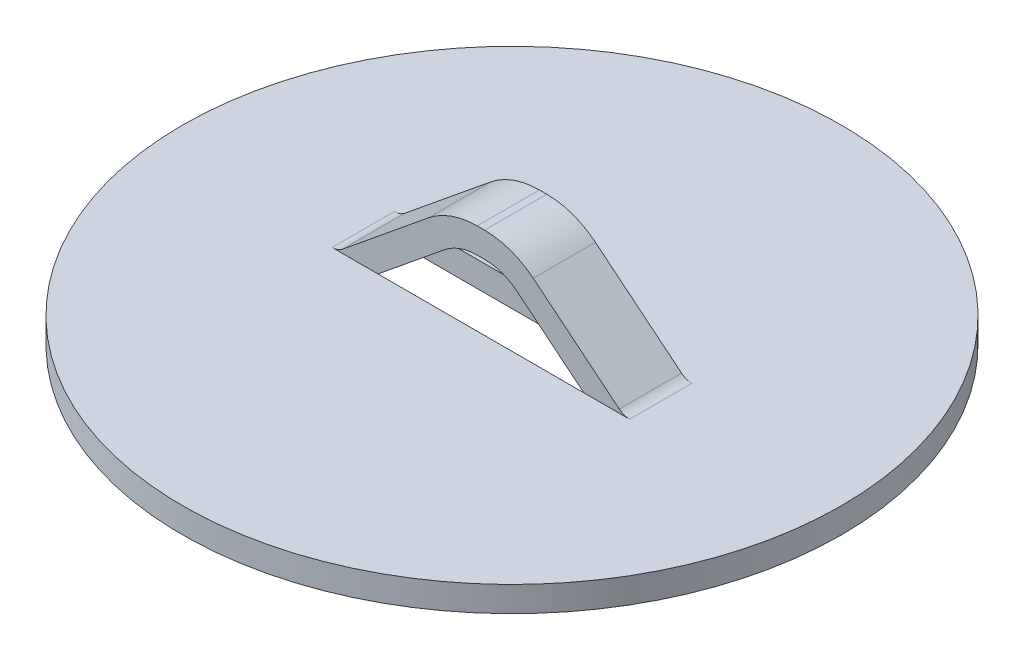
ISO-10303-21;
HEADER;
FILE_DESCRIPTION(('STEP AP214'),'2;1');
FILE_NAME('part.step','',(''),(''),'','','');
FILE_SCHEMA(('AUTOMOTIVE_DESIGN { 1 0 10303 214 1 1 1 1 }'));
ENDSEC;
DATA;
#1=APPLICATION_CONTEXT('core data for automotive mechanical design processes');
#2=APPLICATION_PROTOCOL_DEFINITION('international standard','automotive_design',2000,#1);
#3=PRODUCT_CONTEXT('',#1,'mechanical');
#4=PRODUCT('Part','Part','',(#3));
#5=PRODUCT_RELATED_PRODUCT_CATEGORY('part','',(#4));
#6=PRODUCT_DEFINITION_FORMATION('','',#4);
#7=PRODUCT_DEFINITION_CONTEXT('part definition',#1,'design');
#8=PRODUCT_DEFINITION('design','',#6,#7);
#9=PRODUCT_DEFINITION_SHAPE('','',#8);
#10=(LENGTH_UNIT() NAMED_UNIT(*) SI_UNIT(.MILLI.,.METRE.));
#11=(NAMED_UNIT(*) PLANE_ANGLE_UNIT() SI_UNIT($,.RADIAN.));
#12=(NAMED_UNIT(*) SI_UNIT($,.STERADIAN.) SOLID_ANGLE_UNIT());
#13=UNCERTAINTY_MEASURE_WITH_UNIT(LENGTH_MEASURE(1.E-05),#10,'distance_accuracy_value','');
#14=(GEOMETRIC_REPRESENTATION_CONTEXT(3) GLOBAL_UNCERTAINTY_ASSIGNED_CONTEXT((#13)) GLOBAL_UNIT_ASSIGNED_CONTEXT((#10,
#11,#12)) REPRESENTATION_CONTEXT('',''));
#15=CARTESIAN_POINT('',(0.,0.,0.));
#16=DIRECTION('',(0.,0.,1.));
#17=DIRECTION('',(1.,0.,0.));
#18=AXIS2_PLACEMENT_3D('',#15,#16,#17);
#19=CARTESIAN_POINT('',(-7.16391617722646,0.7874,-2.9972));
#20=DIRECTION('',(0.,0.,-1.));
#21=DIRECTION('',(-1.,0.,0.));
#22=AXIS2_PLACEMENT_3D('',#19,#20,#21);
#23=PLANE('',#22);
#24=DIRECTION('',(0.774751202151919,0.632266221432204,0.));
#25=VECTOR('',#24,1.);
#26=CARTESIAN_POINT('',(-5.89521077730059,-0.767215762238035,-2.9972));
#27=LINE('',#26,#25);
#28=CARTESIAN_POINT('',(-4.95509834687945,0.,-2.9972));
#29=VERTEX_POINT('',#28);
#30=CARTESIAN_POINT('',(-1.75163707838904,2.61431069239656,-2.9972));
#31=VERTEX_POINT('',#30);
#32=EDGE_CURVE('E170',#29,#31,#27,.T.);
#33=ORIENTED_EDGE('',*,*,#32,.F.);
#34=DIRECTION('',(1.,0.,0.));
#35=VECTOR('',#34,1.);
#36=CARTESIAN_POINT('',(-7.16391617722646,0.,-2.9972));
#37=LINE('',#36,#35);
#38=CARTESIAN_POINT('',(-7.16391617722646,0.,-2.9972));
#39=VERTEX_POINT('',#38);
#40=EDGE_CURVE('E163',#39,#29,#37,.T.);
#41=ORIENTED_EDGE('',*,*,#40,.F.);
#42=CARTESIAN_POINT('',(-7.16391617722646,0.7874,-2.9972));
#43=DIRECTION('',(0.,0.,-1.));
#44=DIRECTION('',(-1.,0.,0.));
#45=AXIS2_PLACEMENT_3D('',#42,#43,#44);
#46=CIRCLE('',#45,0.7874);
#47=CARTESIAN_POINT('',(-6.66606975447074,0.177360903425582,-2.9972));
#48=VERTEX_POINT('',#47);
#49=EDGE_CURVE('E167',#48,#39,#46,.T.);
#50=ORIENTED_EDGE('',*,*,#49,.F.);
#51=DIRECTION('',(-0.774751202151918,-0.632266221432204,0.));
#52=VECTOR('',#51,1.);
#53=CARTESIAN_POINT('',(-6.66606975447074,0.177360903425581,-2.9972));
#54=LINE('',#53,#52);
#55=CARTESIAN_POINT('',(-2.52249605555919,3.55888735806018,-2.9972));
#56=VERTEX_POINT('',#55);
#57=EDGE_CURVE('E186',#56,#48,#54,.T.);
#58=ORIENTED_EDGE('',*,*,#57,.F.);
#59=CARTESIAN_POINT('',(-0.177800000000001,0.685799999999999,-2.9972));
#60=DIRECTION('',(0.,0.,1.));
#61=DIRECTION('',(-1.,0.,0.));
#62=AXIS2_PLACEMENT_3D('',#59,#60,#61);
#63=CIRCLE('',#62,3.7084);
#64=CARTESIAN_POINT('',(-0.177800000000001,4.3942,-2.9972));
#65=VERTEX_POINT('',#64);
#66=EDGE_CURVE('E190',#65,#56,#63,.T.);
#67=ORIENTED_EDGE('',*,*,#66,.F.);
#68=DIRECTION('',(-1.,0.,0.));
#69=VECTOR('',#68,1.);
#70=CARTESIAN_POINT('',(-0.177800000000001,4.3942,-2.9972));
#71=LINE('',#70,#69);
#72=CARTESIAN_POINT('',(0.177799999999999,4.3942,-2.9972));
#73=VERTEX_POINT('',#72);
#74=EDGE_CURVE('E320',#73,#65,#71,.T.);
#75=ORIENTED_EDGE('',*,*,#74,.F.);
#76=CARTESIAN_POINT('',(0.1778,0.685799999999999,-2.9972));
#77=DIRECTION('',(0.,0.,1.));
#78=DIRECTION('',(-1.,0.,0.));
#79=AXIS2_PLACEMENT_3D('',#76,#77,#78);
#80=CIRCLE('',#79,3.7084);
#81=CARTESIAN_POINT('',(2.52249605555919,3.55888735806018,-2.9972));
#82=VERTEX_POINT('',#81);
#83=EDGE_CURVE('E317',#82,#73,#80,.T.);
#84=ORIENTED_EDGE('',*,*,#83,.F.);
#85=DIRECTION('',(-0.774751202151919,0.632266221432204,0.));
#86=VECTOR('',#85,1.);
#87=CARTESIAN_POINT('',(2.52249605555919,3.55888735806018,-2.9972));
#88=LINE('',#87,#86);
#89=CARTESIAN_POINT('',(6.66606975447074,0.177360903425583,-2.9972));
#90=VERTEX_POINT('',#89);
#91=EDGE_CURVE('E314',#90,#82,#88,.T.);
#92=ORIENTED_EDGE('',*,*,#91,.F.);
#93=CARTESIAN_POINT('',(7.16391617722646,0.787400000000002,-2.9972));
#94=DIRECTION('',(0.,0.,-1.));
#95=DIRECTION('',(1.,0.,0.));
#96=AXIS2_PLACEMENT_3D('',#93,#94,#95);
#97=CIRCLE('',#96,0.7874);
#98=CARTESIAN_POINT('',(7.16391617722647,0.,-2.9972));
#99=VERTEX_POINT('',#98);
#100=EDGE_CURVE('E311',#99,#90,#97,.T.);
#101=ORIENTED_EDGE('',*,*,#100,.F.);
#102=CARTESIAN_POINT('',(4.95509834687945,0.,-2.9972));
#103=VERTEX_POINT('',#102);
#104=EDGE_CURVE('E177',#103,#99,#37,.T.);
#105=ORIENTED_EDGE('',*,*,#104,.F.);
#106=DIRECTION('',(0.774751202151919,-0.632266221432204,0.));
#107=VECTOR('',#106,1.);
#108=CARTESIAN_POINT('',(1.75163707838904,2.61431069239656,-2.9972));
#109=LINE('',#108,#107);
#110=CARTESIAN_POINT('',(1.75163707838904,2.61431069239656,-2.9972));
#111=VERTEX_POINT('',#110);
#112=EDGE_CURVE('E305',#111,#103,#109,.T.);
#113=ORIENTED_EDGE('',*,*,#112,.F.);
#114=CARTESIAN_POINT('',(0.1778,0.685799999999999,-2.9972));
#115=DIRECTION('',(0.,0.,-1.));
#116=DIRECTION('',(-1.,0.,0.));
#117=AXIS2_PLACEMENT_3D('',#114,#115,#116);
#118=CIRCLE('',#117,2.4892);
#119=CARTESIAN_POINT('',(0.1778,3.175,-2.9972));
#120=VERTEX_POINT('',#119);
#121=EDGE_CURVE('E301',#120,#111,#118,.T.);
#122=ORIENTED_EDGE('',*,*,#121,.F.);
#123=DIRECTION('',(1.,0.,0.));
#124=VECTOR('',#123,1.);
#125=CARTESIAN_POINT('',(-0.1778,3.175,-2.9972));
#126=LINE('',#125,#124);
#127=CARTESIAN_POINT('',(-0.1778,3.175,-2.9972));
#128=VERTEX_POINT('',#127);
#129=EDGE_CURVE('E298',#128,#120,#126,.T.);
#130=ORIENTED_EDGE('',*,*,#129,.F.);
#131=CARTESIAN_POINT('',(-0.177800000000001,0.685799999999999,-2.9972));
#132=DIRECTION('',(0.,0.,-1.));
#133=DIRECTION('',(-1.,0.,0.));
#134=AXIS2_PLACEMENT_3D('',#131,#132,#133);
#135=CIRCLE('',#134,2.4892);
#136=EDGE_CURVE('E295',#31,#128,#135,.T.);
#137=ORIENTED_EDGE('',*,*,#136,.F.);
#138=EDGE_LOOP('',(#33,#41,#50,#58,#67,#75,#84,#92,#101,#105,#113,#122,#130,#137));
#139=FACE_BOUND('',#138,.T.);
#140=ADVANCED_FACE('F37',(#139),#23,.T.);
#141=CARTESIAN_POINT('',(-7.16391617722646,0.7874,0.));
#142=DIRECTION('',(0.,0.,-1.));
#143=DIRECTION('',(-1.,0.,0.));
#144=AXIS2_PLACEMENT_3D('',#141,#142,#143);
#145=PLANE('',#144);
#146=DIRECTION('',(-1.,0.,0.));
#147=VECTOR('',#146,1.);
#148=CARTESIAN_POINT('',(-7.16391617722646,0.,0.));
#149=LINE('',#148,#147);
#150=CARTESIAN_POINT('',(-4.95509834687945,0.,0.));
#151=VERTEX_POINT('',#150);
#152=CARTESIAN_POINT('',(-7.16391617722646,0.,0.));
#153=VERTEX_POINT('',#152);
#154=EDGE_CURVE('E11',#151,#153,#149,.T.);
#155=ORIENTED_EDGE('',*,*,#154,.F.);
#156=DIRECTION('',(0.774751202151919,0.632266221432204,0.));
#157=VECTOR('',#156,1.);
#158=CARTESIAN_POINT('',(-5.89521077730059,-0.767215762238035,0.));
#159=LINE('',#158,#157);
#160=CARTESIAN_POINT('',(-1.75163707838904,2.61431069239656,0.));
#161=VERTEX_POINT('',#160);
#162=EDGE_CURVE('E197',#151,#161,#159,.T.);
#163=ORIENTED_EDGE('',*,*,#162,.T.);
#164=CARTESIAN_POINT('',(-0.177800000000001,0.685799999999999,0.));
#165=DIRECTION('',(0.,0.,-1.));
#166=DIRECTION('',(-1.,0.,0.));
#167=AXIS2_PLACEMENT_3D('',#164,#165,#166);
#168=CIRCLE('',#167,2.4892);
#169=CARTESIAN_POINT('',(-0.1778,3.175,0.));
#170=VERTEX_POINT('',#169);
#171=EDGE_CURVE('E202',#161,#170,#168,.T.);
#172=ORIENTED_EDGE('',*,*,#171,.T.);
#173=DIRECTION('',(1.,0.,0.));
#174=VECTOR('',#173,1.);
#175=CARTESIAN_POINT('',(-0.1778,3.175,0.));
#176=LINE('',#175,#174);
#177=CARTESIAN_POINT('',(0.1778,3.175,0.));
#178=VERTEX_POINT('',#177);
#179=EDGE_CURVE('E205',#170,#178,#176,.T.);
#180=ORIENTED_EDGE('',*,*,#179,.T.);
#181=CARTESIAN_POINT('',(0.1778,0.685799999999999,0.));
#182=DIRECTION('',(0.,0.,-1.));
#183=DIRECTION('',(-1.,0.,0.));
#184=AXIS2_PLACEMENT_3D('',#181,#182,#183);
#185=CIRCLE('',#184,2.4892);
#186=CARTESIAN_POINT('',(1.75163707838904,2.61431069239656,0.));
#187=VERTEX_POINT('',#186);
#188=EDGE_CURVE('E208',#178,#187,#185,.T.);
#189=ORIENTED_EDGE('',*,*,#188,.T.);
#190=DIRECTION('',(0.774751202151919,-0.632266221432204,0.));
#191=VECTOR('',#190,1.);
#192=CARTESIAN_POINT('',(1.75163707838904,2.61431069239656,0.));
#193=LINE('',#192,#191);
#194=CARTESIAN_POINT('',(4.95509834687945,0.,0.));
#195=VERTEX_POINT('',#194);
#196=EDGE_CURVE('E211',#187,#195,#193,.T.);
#197=ORIENTED_EDGE('',*,*,#196,.T.);
#198=DIRECTION('',(-1.,0.,0.));
#199=VECTOR('',#198,1.);
#200=CARTESIAN_POINT('',(-7.16391617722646,0.,0.));
#201=LINE('',#200,#199);
#202=CARTESIAN_POINT('',(7.16391617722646,0.,0.));
#203=VERTEX_POINT('',#202);
#204=EDGE_CURVE('E291',#203,#195,#201,.T.);
#205=ORIENTED_EDGE('',*,*,#204,.F.);
#206=CARTESIAN_POINT('',(7.16391617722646,0.787400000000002,0.));
#207=DIRECTION('',(0.,0.,-1.));
#208=DIRECTION('',(1.,0.,0.));
#209=AXIS2_PLACEMENT_3D('',#206,#207,#208);
#210=CIRCLE('',#209,0.7874);
#211=CARTESIAN_POINT('',(6.66606975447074,0.177360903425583,0.));
#212=VERTEX_POINT('',#211);
#213=EDGE_CURVE('E216',#203,#212,#210,.T.);
#214=ORIENTED_EDGE('',*,*,#213,.T.);
#215=DIRECTION('',(-0.774751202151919,0.632266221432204,0.));
#216=VECTOR('',#215,1.);
#217=CARTESIAN_POINT('',(2.52249605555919,3.55888735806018,0.));
#218=LINE('',#217,#216);
#219=CARTESIAN_POINT('',(2.52249605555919,3.55888735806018,0.));
#220=VERTEX_POINT('',#219);
#221=EDGE_CURVE('E219',#212,#220,#218,.T.);
#222=ORIENTED_EDGE('',*,*,#221,.T.);
#223=CARTESIAN_POINT('',(0.1778,0.685799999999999,0.));
#224=DIRECTION('',(0.,0.,1.));
#225=DIRECTION('',(-1.,0.,0.));
#226=AXIS2_PLACEMENT_3D('',#223,#224,#225);
#227=CIRCLE('',#226,3.7084);
#228=CARTESIAN_POINT('',(0.177799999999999,4.3942,0.));
#229=VERTEX_POINT('',#228);
#230=EDGE_CURVE('E222',#220,#229,#227,.T.);
#231=ORIENTED_EDGE('',*,*,#230,.T.);
#232=DIRECTION('',(-1.,0.,0.));
#233=VECTOR('',#232,1.);
#234=CARTESIAN_POINT('',(-0.177800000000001,4.3942,0.));
#235=LINE('',#234,#233);
#236=CARTESIAN_POINT('',(-0.177800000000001,4.3942,0.));
#237=VERTEX_POINT('',#236);
#238=EDGE_CURVE('E225',#229,#237,#235,.T.);
#239=ORIENTED_EDGE('',*,*,#238,.T.);
#240=CARTESIAN_POINT('',(-0.177800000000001,0.685799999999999,0.));
#241=DIRECTION('',(0.,0.,1.));
#242=DIRECTION('',(-1.,0.,0.));
#243=AXIS2_PLACEMENT_3D('',#240,#241,#242);
#244=CIRCLE('',#243,3.7084);
#245=CARTESIAN_POINT('',(-2.52249605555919,3.55888735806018,0.));
#246=VERTEX_POINT('',#245);
#247=EDGE_CURVE('E228',#237,#246,#244,.T.);
#248=ORIENTED_EDGE('',*,*,#247,.T.);
#249=DIRECTION('',(-0.774751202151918,-0.632266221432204,0.));
#250=VECTOR('',#249,1.);
#251=CARTESIAN_POINT('',(-6.66606975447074,0.177360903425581,0.));
#252=LINE('',#251,#250);
#253=CARTESIAN_POINT('',(-6.66606975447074,0.177360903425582,0.));
#254=VERTEX_POINT('',#253);
#255=EDGE_CURVE('E231',#246,#254,#252,.T.);
#256=ORIENTED_EDGE('',*,*,#255,.T.);
#257=CARTESIAN_POINT('',(-7.16391617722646,0.7874,0.));
#258=DIRECTION('',(0.,0.,-1.));
#259=DIRECTION('',(-1.,0.,0.));
#260=AXIS2_PLACEMENT_3D('',#257,#258,#259);
#261=CIRCLE('',#260,0.7874);
#262=EDGE_CURVE('E234',#254,#153,#261,.T.);
#263=ORIENTED_EDGE('',*,*,#262,.T.);
#264=EDGE_LOOP('',(#155,#163,#172,#180,#189,#197,#205,#214,#222,#231,#239,#248,#256,#263));
#265=FACE_BOUND('',#264,.T.);
#266=ADVANCED_FACE('F365',(#265),#145,.F.);
#267=CARTESIAN_POINT('',(-15.875,0.,-2.9972));
#268=DIRECTION('',(0.,1.,0.));
#269=DIRECTION('',(-1.,0.,0.));
#270=AXIS2_PLACEMENT_3D('',#267,#268,#269);
#271=PLANE('',#270);
#272=CARTESIAN_POINT('',(0.,0.,-1.4986));
#273=DIRECTION('',(0.,-1.,0.));
#274=DIRECTION('',(1.,0.,0.));
#275=AXIS2_PLACEMENT_3D('',#272,#273,#274);
#276=CIRCLE('',#275,15.875);
#277=CARTESIAN_POINT('',(15.875,0.,-1.4986));
#278=VERTEX_POINT('',#277);
#279=EDGE_CURVE('E198',#278,#278,#276,.T.);
#280=ORIENTED_EDGE('',*,*,#279,.F.);
#281=EDGE_LOOP('',(#280));
#282=FACE_BOUND('',#281,.T.);
#283=ORIENTED_EDGE('',*,*,#104,.T.);
#284=DIRECTION('',(0.,0.,1.));
#285=VECTOR('',#284,1.);
#286=CARTESIAN_POINT('',(7.16391617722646,0.,-2.9972));
#287=LINE('',#286,#285);
#288=EDGE_CURVE('E248',#99,#203,#287,.T.);
#289=ORIENTED_EDGE('',*,*,#288,.T.);
#290=ORIENTED_EDGE('',*,*,#204,.T.);
#291=EDGE_CURVE('E174',#195,#151,#201,.T.);
#292=ORIENTED_EDGE('',*,*,#291,.T.);
#293=ORIENTED_EDGE('',*,*,#154,.T.);
#294=DIRECTION('',(0.,0.,1.));
#295=VECTOR('',#294,1.);
#296=CARTESIAN_POINT('',(-7.16391617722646,0.,-2.9972));
#297=LINE('',#296,#295);
#298=EDGE_CURVE('E45',#39,#153,#297,.T.);
#299=ORIENTED_EDGE('',*,*,#298,.F.);
#300=ORIENTED_EDGE('',*,*,#40,.T.);
#301=EDGE_CURVE('E175',#29,#103,#37,.T.);
#302=ORIENTED_EDGE('',*,*,#301,.T.);
#303=EDGE_LOOP('',(#283,#289,#290,#292,#293,#299,#300,#302));
#304=FACE_BOUND('',#303,.T.);
#305=ADVANCED_FACE('F178',(#282,#304),#271,.T.);
#306=CARTESIAN_POINT('',(-7.16391617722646,0.7874,-2.9972));
#307=DIRECTION('',(0.,0.,1.));
#308=DIRECTION('',(1.,0.,0.));
#309=AXIS2_PLACEMENT_3D('',#306,#307,#308);
#310=CYLINDRICAL_SURFACE('',#309,0.7874);
#311=ORIENTED_EDGE('',*,*,#262,.F.);
#312=DIRECTION('',(0.,0.,1.));
#313=VECTOR('',#312,1.);
#314=CARTESIAN_POINT('',(-6.66606975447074,0.177360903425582,-2.9972));
#315=LINE('',#314,#313);
#316=EDGE_CURVE('E182',#48,#254,#315,.T.);
#317=ORIENTED_EDGE('',*,*,#316,.F.);
#318=ORIENTED_EDGE('',*,*,#49,.T.);
#319=ORIENTED_EDGE('',*,*,#298,.T.);
#320=EDGE_LOOP('',(#311,#317,#318,#319));
#321=FACE_BOUND('',#320,.T.);
#322=ADVANCED_FACE('F184',(#321),#310,.F.);
#323=CARTESIAN_POINT('',(-6.66606975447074,0.177360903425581,-2.9972));
#324=DIRECTION('',(-0.632266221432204,0.774751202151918,0.));
#325=DIRECTION('',(-0.774751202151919,-0.632266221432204,0.));
#326=AXIS2_PLACEMENT_3D('',#323,#324,#325);
#327=PLANE('',#326);
#328=ORIENTED_EDGE('',*,*,#255,.F.);
#329=DIRECTION('',(0.,0.,1.));
#330=VECTOR('',#329,1.);
#331=CARTESIAN_POINT('',(-2.52249605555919,3.55888735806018,-2.9972));
#332=LINE('',#331,#330);
#333=EDGE_CURVE('E238',#56,#246,#332,.T.);
#334=ORIENTED_EDGE('',*,*,#333,.F.);
#335=ORIENTED_EDGE('',*,*,#57,.T.);
#336=ORIENTED_EDGE('',*,*,#316,.T.);
#337=EDGE_LOOP('',(#328,#334,#335,#336));
#338=FACE_BOUND('',#337,.T.);
#339=ADVANCED_FACE('F367',(#338),#327,.T.);
#340=CARTESIAN_POINT('',(-0.177800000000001,0.685799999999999,-2.9972));
#341=DIRECTION('',(0.,0.,1.));
#342=DIRECTION('',(1.,0.,0.));
#343=AXIS2_PLACEMENT_3D('',#340,#341,#342);
#344=CYLINDRICAL_SURFACE('',#343,3.7084);
#345=ORIENTED_EDGE('',*,*,#247,.F.);
#346=DIRECTION('',(0.,0.,1.));
#347=VECTOR('',#346,1.);
#348=CARTESIAN_POINT('',(-0.177800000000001,4.3942,-2.9972));
#349=LINE('',#348,#347);
#350=EDGE_CURVE('E240',#65,#237,#349,.T.);
#351=ORIENTED_EDGE('',*,*,#350,.F.);
#352=ORIENTED_EDGE('',*,*,#66,.T.);
#353=ORIENTED_EDGE('',*,*,#333,.T.);
#354=EDGE_LOOP('',(#345,#351,#352,#353));
#355=FACE_BOUND('',#354,.T.);
#356=ADVANCED_FACE('F326',(#355),#344,.T.);
#357=CARTESIAN_POINT('',(-0.177800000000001,4.3942,-2.9972));
#358=DIRECTION('',(0.,1.,0.));
#359=DIRECTION('',(0.,0.,1.));
#360=AXIS2_PLACEMENT_3D('',#357,#358,#359);
#361=PLANE('',#360);
#362=ORIENTED_EDGE('',*,*,#238,.F.);
#363=DIRECTION('',(0.,0.,1.));
#364=VECTOR('',#363,1.);
#365=CARTESIAN_POINT('',(0.177799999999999,4.3942,-2.9972));
#366=LINE('',#365,#364);
#367=EDGE_CURVE('E242',#73,#229,#366,.T.);
#368=ORIENTED_EDGE('',*,*,#367,.F.);
#369=ORIENTED_EDGE('',*,*,#74,.T.);
#370=ORIENTED_EDGE('',*,*,#350,.T.);
#371=EDGE_LOOP('',(#362,#368,#369,#370));
#372=FACE_BOUND('',#371,.T.);
#373=ADVANCED_FACE('F332',(#372),#361,.T.);
#374=CARTESIAN_POINT('',(0.1778,0.685799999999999,-2.9972));
#375=DIRECTION('',(0.,0.,1.));
#376=DIRECTION('',(1.,0.,0.));
#377=AXIS2_PLACEMENT_3D('',#374,#375,#376);
#378=CYLINDRICAL_SURFACE('',#377,3.7084);
#379=ORIENTED_EDGE('',*,*,#230,.F.);
#380=DIRECTION('',(0.,0.,1.));
#381=VECTOR('',#380,1.);
#382=CARTESIAN_POINT('',(2.52249605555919,3.55888735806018,-2.9972));
#383=LINE('',#382,#381);
#384=EDGE_CURVE('E244',#82,#220,#383,.T.);
#385=ORIENTED_EDGE('',*,*,#384,.F.);
#386=ORIENTED_EDGE('',*,*,#83,.T.);
#387=ORIENTED_EDGE('',*,*,#367,.T.);
#388=EDGE_LOOP('',(#379,#385,#386,#387));
#389=FACE_BOUND('',#388,.T.);
#390=ADVANCED_FACE('F335',(#389),#378,.T.);
#391=CARTESIAN_POINT('',(2.52249605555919,3.55888735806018,-2.9972));
#392=DIRECTION('',(0.632266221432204,0.774751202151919,0.));
#393=DIRECTION('',(-0.774751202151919,0.632266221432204,0.));
#394=AXIS2_PLACEMENT_3D('',#391,#392,#393);
#395=PLANE('',#394);
#396=ORIENTED_EDGE('',*,*,#221,.F.);
#397=DIRECTION('',(0.,0.,1.));
#398=VECTOR('',#397,1.);
#399=CARTESIAN_POINT('',(6.66606975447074,0.177360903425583,-2.9972));
#400=LINE('',#399,#398);
#401=EDGE_CURVE('E246',#90,#212,#400,.T.);
#402=ORIENTED_EDGE('',*,*,#401,.F.);
#403=ORIENTED_EDGE('',*,*,#91,.T.);
#404=ORIENTED_EDGE('',*,*,#384,.T.);
#405=EDGE_LOOP('',(#396,#402,#403,#404));
#406=FACE_BOUND('',#405,.T.);
#407=ADVANCED_FACE('F340',(#406),#395,.T.);
#408=CARTESIAN_POINT('',(7.16391617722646,0.787400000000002,-2.9972));
#409=DIRECTION('',(0.,0.,1.));
#410=DIRECTION('',(1.,0.,0.));
#411=AXIS2_PLACEMENT_3D('',#408,#409,#410);
#412=CYLINDRICAL_SURFACE('',#411,0.7874);
#413=ORIENTED_EDGE('',*,*,#213,.F.);
#414=ORIENTED_EDGE('',*,*,#288,.F.);
#415=ORIENTED_EDGE('',*,*,#100,.T.);
#416=ORIENTED_EDGE('',*,*,#401,.T.);
#417=EDGE_LOOP('',(#413,#414,#415,#416));
#418=FACE_BOUND('',#417,.T.);
#419=ADVANCED_FACE('F343',(#418),#412,.F.);
#420=CARTESIAN_POINT('',(7.16391617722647,-1.2192,-2.9972));
#421=DIRECTION('',(0.,-1.,0.));
#422=DIRECTION('',(1.,0.,0.));
#423=AXIS2_PLACEMENT_3D('',#420,#421,#422);
#424=PLANE('',#423);
#425=CARTESIAN_POINT('',(0.,-1.2192,-1.4986));
#426=DIRECTION('',(0.,-1.,0.));
#427=DIRECTION('',(1.,0.,0.));
#428=AXIS2_PLACEMENT_3D('',#425,#426,#427);
#429=CIRCLE('',#428,15.875);
#430=CARTESIAN_POINT('',(15.875,-1.2192,-1.4986));
#431=VERTEX_POINT('',#430);
#432=EDGE_CURVE('E288',#431,#431,#429,.T.);
#433=ORIENTED_EDGE('',*,*,#432,.T.);
#434=EDGE_LOOP('',(#433));
#435=FACE_BOUND('',#434,.T.);
#436=DIRECTION('',(0.,0.,1.));
#437=VECTOR('',#436,1.);
#438=CARTESIAN_POINT('',(-7.16391617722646,-1.2192,-2.9972));
#439=LINE('',#438,#437);
#440=CARTESIAN_POINT('',(-7.16391617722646,-1.2192,-2.9972));
#441=VERTEX_POINT('',#440);
#442=CARTESIAN_POINT('',(-7.16391617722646,-1.2192,0.));
#443=VERTEX_POINT('',#442);
#444=EDGE_CURVE('E185',#441,#443,#439,.T.);
#445=ORIENTED_EDGE('',*,*,#444,.T.);
#446=DIRECTION('',(-1.,0.,0.));
#447=VECTOR('',#446,1.);
#448=CARTESIAN_POINT('',(-7.16391617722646,-1.2192,0.));
#449=LINE('',#448,#447);
#450=CARTESIAN_POINT('',(7.16391617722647,-1.2192,0.));
#451=VERTEX_POINT('',#450);
#452=EDGE_CURVE('E277',#451,#443,#449,.T.);
#453=ORIENTED_EDGE('',*,*,#452,.F.);
#454=DIRECTION('',(0.,0.,1.));
#455=VECTOR('',#454,1.);
#456=CARTESIAN_POINT('',(7.16391617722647,-1.2192,-2.9972));
#457=LINE('',#456,#455);
#458=CARTESIAN_POINT('',(7.16391617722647,-1.2192,-2.9972));
#459=VERTEX_POINT('',#458);
#460=EDGE_CURVE('E251',#459,#451,#457,.T.);
#461=ORIENTED_EDGE('',*,*,#460,.F.);
#462=DIRECTION('',(1.,0.,0.));
#463=VECTOR('',#462,1.);
#464=CARTESIAN_POINT('',(-7.16391617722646,-1.2192,-2.9972));
#465=LINE('',#464,#463);
#466=EDGE_CURVE('E281',#441,#459,#465,.T.);
#467=ORIENTED_EDGE('',*,*,#466,.F.);
#468=EDGE_LOOP('',(#445,#453,#461,#467));
#469=FACE_BOUND('',#468,.T.);
#470=ADVANCED_FACE('F396',(#435,#469),#424,.T.);
#471=CARTESIAN_POINT('',(7.16391617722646,0.787400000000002,-2.9972));
#472=DIRECTION('',(0.,0.,1.));
#473=DIRECTION('',(1.,0.,0.));
#474=AXIS2_PLACEMENT_3D('',#471,#472,#473);
#475=CYLINDRICAL_SURFACE('',#474,2.0066);
#476=CARTESIAN_POINT('',(7.16391617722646,0.787400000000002,0.));
#477=DIRECTION('',(0.,0.,1.));
#478=DIRECTION('',(1.,0.,0.));
#479=AXIS2_PLACEMENT_3D('',#476,#477,#478);
#480=CIRCLE('',#479,2.0066);
#481=CARTESIAN_POINT('',(5.8952107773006,-0.767215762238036,0.));
#482=VERTEX_POINT('',#481);
#483=EDGE_CURVE('E213',#482,#451,#480,.T.);
#484=ORIENTED_EDGE('',*,*,#483,.F.);
#485=DIRECTION('',(0.,0.,1.));
#486=VECTOR('',#485,1.);
#487=CARTESIAN_POINT('',(5.8952107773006,-0.767215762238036,-2.9972));
#488=LINE('',#487,#486);
#489=CARTESIAN_POINT('',(5.8952107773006,-0.767215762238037,-2.9972));
#490=VERTEX_POINT('',#489);
#491=EDGE_CURVE('E253',#490,#482,#488,.T.);
#492=ORIENTED_EDGE('',*,*,#491,.F.);
#493=CARTESIAN_POINT('',(7.16391617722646,0.787400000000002,-2.9972));
#494=DIRECTION('',(0.,0.,1.));
#495=DIRECTION('',(1.,0.,0.));
#496=AXIS2_PLACEMENT_3D('',#493,#494,#495);
#497=CIRCLE('',#496,2.0066);
#498=EDGE_CURVE('E308',#490,#459,#497,.T.);
#499=ORIENTED_EDGE('',*,*,#498,.T.);
#500=ORIENTED_EDGE('',*,*,#460,.T.);
#501=EDGE_LOOP('',(#484,#492,#499,#500));
#502=FACE_BOUND('',#501,.T.);
#503=ADVANCED_FACE('F398',(#502),#475,.T.);
#504=CARTESIAN_POINT('',(1.75163707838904,2.61431069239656,-2.9972));
#505=DIRECTION('',(-0.632266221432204,-0.774751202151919,0.));
#506=DIRECTION('',(0.774751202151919,-0.632266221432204,0.));
#507=AXIS2_PLACEMENT_3D('',#504,#505,#506);
#508=PLANE('',#507);
#509=ORIENTED_EDGE('',*,*,#196,.F.);
#510=DIRECTION('',(0.,0.,1.));
#511=VECTOR('',#510,1.);
#512=CARTESIAN_POINT('',(1.75163707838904,2.61431069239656,-2.9972));
#513=LINE('',#512,#511);
#514=EDGE_CURVE('E255',#111,#187,#513,.T.);
#515=ORIENTED_EDGE('',*,*,#514,.F.);
#516=ORIENTED_EDGE('',*,*,#112,.T.);
#517=EDGE_CURVE('E304',#103,#490,#109,.T.);
#518=ORIENTED_EDGE('',*,*,#517,.T.);
#519=ORIENTED_EDGE('',*,*,#491,.T.);
#520=EDGE_CURVE('E52',#195,#482,#193,.T.);
#521=ORIENTED_EDGE('',*,*,#520,.F.);
#522=EDGE_LOOP('',(#509,#515,#516,#518,#519,#521));
#523=FACE_BOUND('',#522,.T.);
#524=ADVANCED_FACE('F349',(#523),#508,.T.);
#525=CARTESIAN_POINT('',(0.1778,0.685799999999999,-2.9972));
#526=DIRECTION('',(0.,0.,1.));
#527=DIRECTION('',(1.,0.,0.));
#528=AXIS2_PLACEMENT_3D('',#525,#526,#527);
#529=CYLINDRICAL_SURFACE('',#528,2.4892);
#530=ORIENTED_EDGE('',*,*,#188,.F.);
#531=DIRECTION('',(0.,0.,1.));
#532=VECTOR('',#531,1.);
#533=CARTESIAN_POINT('',(0.1778,3.175,-2.9972));
#534=LINE('',#533,#532);
#535=EDGE_CURVE('E257',#120,#178,#534,.T.);
#536=ORIENTED_EDGE('',*,*,#535,.F.);
#537=ORIENTED_EDGE('',*,*,#121,.T.);
#538=ORIENTED_EDGE('',*,*,#514,.T.);
#539=EDGE_LOOP('',(#530,#536,#537,#538));
#540=FACE_BOUND('',#539,.T.);
#541=ADVANCED_FACE('F353',(#540),#529,.F.);
#542=CARTESIAN_POINT('',(-0.1778,3.175,-2.9972));
#543=DIRECTION('',(0.,-1.,0.));
#544=DIRECTION('',(1.,0.,0.));
#545=AXIS2_PLACEMENT_3D('',#542,#543,#544);
#546=PLANE('',#545);
#547=ORIENTED_EDGE('',*,*,#179,.F.);
#548=DIRECTION('',(0.,0.,1.));
#549=VECTOR('',#548,1.);
#550=CARTESIAN_POINT('',(-0.1778,3.175,-2.9972));
#551=LINE('',#550,#549);
#552=EDGE_CURVE('E259',#128,#170,#551,.T.);
#553=ORIENTED_EDGE('',*,*,#552,.F.);
#554=ORIENTED_EDGE('',*,*,#129,.T.);
#555=ORIENTED_EDGE('',*,*,#535,.T.);
#556=EDGE_LOOP('',(#547,#553,#554,#555));
#557=FACE_BOUND('',#556,.T.);
#558=ADVANCED_FACE('F357',(#557),#546,.T.);
#559=CARTESIAN_POINT('',(-0.177800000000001,0.685799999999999,-2.9972));
#560=DIRECTION('',(0.,0.,1.));
#561=DIRECTION('',(1.,0.,0.));
#562=AXIS2_PLACEMENT_3D('',#559,#560,#561);
#563=CYLINDRICAL_SURFACE('',#562,2.4892);
#564=ORIENTED_EDGE('',*,*,#171,.F.);
#565=DIRECTION('',(0.,0.,1.));
#566=VECTOR('',#565,1.);
#567=CARTESIAN_POINT('',(-1.75163707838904,2.61431069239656,-2.9972));
#568=LINE('',#567,#566);
#569=EDGE_CURVE('E261',#31,#161,#568,.T.);
#570=ORIENTED_EDGE('',*,*,#569,.F.);
#571=ORIENTED_EDGE('',*,*,#136,.T.);
#572=ORIENTED_EDGE('',*,*,#552,.T.);
#573=EDGE_LOOP('',(#564,#570,#571,#572));
#574=FACE_BOUND('',#573,.T.);
#575=ADVANCED_FACE('F360',(#574),#563,.F.);
#576=CARTESIAN_POINT('',(-5.89521077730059,-0.767215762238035,-2.9972));
#577=DIRECTION('',(0.632266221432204,-0.774751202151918,0.));
#578=DIRECTION('',(0.774751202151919,0.632266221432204,0.));
#579=AXIS2_PLACEMENT_3D('',#576,#577,#578);
#580=PLANE('',#579);
#581=CARTESIAN_POINT('',(-5.89521077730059,-0.767215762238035,0.));
#582=VERTEX_POINT('',#581);
#583=EDGE_CURVE('E199',#582,#151,#159,.T.);
#584=ORIENTED_EDGE('',*,*,#583,.F.);
#585=DIRECTION('',(0.,0.,1.));
#586=VECTOR('',#585,1.);
#587=CARTESIAN_POINT('',(-5.89521077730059,-0.767215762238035,-2.9972));
#588=LINE('',#587,#586);
#589=CARTESIAN_POINT('',(-5.89521077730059,-0.767215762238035,-2.9972));
#590=VERTEX_POINT('',#589);
#591=EDGE_CURVE('E189',#590,#582,#588,.T.);
#592=ORIENTED_EDGE('',*,*,#591,.F.);
#593=EDGE_CURVE('E293',#590,#29,#27,.T.);
#594=ORIENTED_EDGE('',*,*,#593,.T.);
#595=ORIENTED_EDGE('',*,*,#32,.T.);
#596=ORIENTED_EDGE('',*,*,#569,.T.);
#597=ORIENTED_EDGE('',*,*,#162,.F.);
#598=EDGE_LOOP('',(#584,#592,#594,#595,#596,#597));
#599=FACE_BOUND('',#598,.T.);
#600=ADVANCED_FACE('F271',(#599),#580,.T.);
#601=CARTESIAN_POINT('',(-7.16391617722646,0.7874,-2.9972));
#602=DIRECTION('',(0.,0.,1.));
#603=DIRECTION('',(1.,0.,0.));
#604=AXIS2_PLACEMENT_3D('',#601,#602,#603);
#605=CYLINDRICAL_SURFACE('',#604,2.0066);
#606=CARTESIAN_POINT('',(-7.16391617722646,0.7874,0.));
#607=DIRECTION('',(0.,0.,1.));
#608=DIRECTION('',(-1.,0.,0.));
#609=AXIS2_PLACEMENT_3D('',#606,#607,#608);
#610=CIRCLE('',#609,2.0066);
#611=EDGE_CURVE('E194',#443,#582,#610,.T.);
#612=ORIENTED_EDGE('',*,*,#611,.F.);
#613=ORIENTED_EDGE('',*,*,#444,.F.);
#614=CARTESIAN_POINT('',(-7.16391617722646,0.7874,-2.9972));
#615=DIRECTION('',(0.,0.,1.));
#616=DIRECTION('',(-1.,0.,0.));
#617=AXIS2_PLACEMENT_3D('',#614,#615,#616);
#618=CIRCLE('',#617,2.0066);
#619=EDGE_CURVE('E235',#441,#590,#618,.T.);
#620=ORIENTED_EDGE('',*,*,#619,.T.);
#621=ORIENTED_EDGE('',*,*,#591,.T.);
#622=EDGE_LOOP('',(#612,#613,#620,#621));
#623=FACE_BOUND('',#622,.T.);
#624=ADVANCED_FACE('F39',(#623),#605,.T.);
#625=CARTESIAN_POINT('',(-7.16391617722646,0.,0.));
#626=DIRECTION('',(0.,0.,1.));
#627=DIRECTION('',(1.,0.,0.));
#628=AXIS2_PLACEMENT_3D('',#625,#626,#627);
#629=PLANE('',#628);
#630=ORIENTED_EDGE('',*,*,#483,.T.);
#631=ORIENTED_EDGE('',*,*,#452,.T.);
#632=ORIENTED_EDGE('',*,*,#611,.T.);
#633=ORIENTED_EDGE('',*,*,#583,.T.);
#634=ORIENTED_EDGE('',*,*,#291,.F.);
#635=ORIENTED_EDGE('',*,*,#520,.T.);
#636=EDGE_LOOP('',(#630,#631,#632,#633,#634,#635));
#637=FACE_BOUND('',#636,.T.);
#638=ADVANCED_FACE('F275',(#637),#629,.F.);
#639=CARTESIAN_POINT('',(0.,0.,-1.4986));
#640=DIRECTION('',(0.,-1.,0.));
#641=DIRECTION('',(1.,0.,0.));
#642=AXIS2_PLACEMENT_3D('',#639,#640,#641);
#643=CYLINDRICAL_SURFACE('',#642,15.875);
#644=ORIENTED_EDGE('',*,*,#279,.T.);
#645=EDGE_LOOP('',(#644));
#646=FACE_BOUND('',#645,.T.);
#647=ORIENTED_EDGE('',*,*,#432,.F.);
#648=EDGE_LOOP('',(#647));
#649=FACE_BOUND('',#648,.T.);
#650=ADVANCED_FACE('F383',(#646,#649),#643,.T.);
#651=CARTESIAN_POINT('',(-7.16391617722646,0.,-2.9972));
#652=DIRECTION('',(0.,0.,-1.));
#653=DIRECTION('',(-1.,0.,0.));
#654=AXIS2_PLACEMENT_3D('',#651,#652,#653);
#655=PLANE('',#654);
#656=ORIENTED_EDGE('',*,*,#498,.F.);
#657=ORIENTED_EDGE('',*,*,#517,.F.);
#658=ORIENTED_EDGE('',*,*,#301,.F.);
#659=ORIENTED_EDGE('',*,*,#593,.F.);
#660=ORIENTED_EDGE('',*,*,#619,.F.);
#661=ORIENTED_EDGE('',*,*,#466,.T.);
#662=EDGE_LOOP('',(#656,#657,#658,#659,#660,#661));
#663=FACE_BOUND('',#662,.T.);
#664=ADVANCED_FACE('F363',(#663),#655,.F.);
#665=CLOSED_SHELL('',(#140,#266,#305,#322,#339,#356,#373,#390,#407,#419,#470,#503,#524,#541,
#558,#575,#600,#624,#638,#650,#664));
#666=MANIFOLD_SOLID_BREP('B2',#665);
#667=ADVANCED_BREP_SHAPE_REPRESENTATION('',(#18,#666),#14);
#668=SHAPE_DEFINITION_REPRESENTATION(#9,#667);
ENDSEC;
END-ISO-10303-21;
